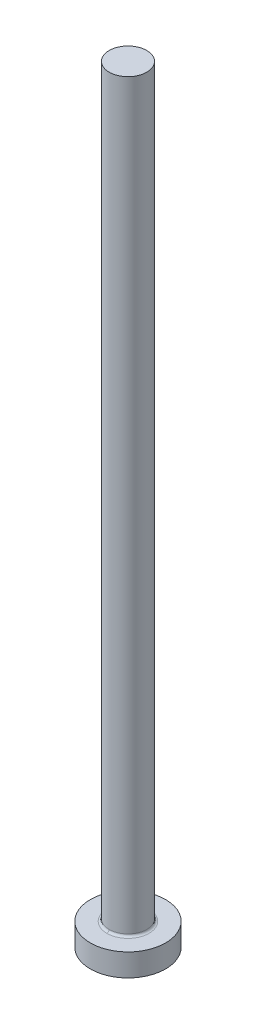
ISO-10303-21;
HEADER;
FILE_DESCRIPTION(('STEP AP214'),'2;1');
FILE_NAME('part.step','',(''),(''),'','','');
FILE_SCHEMA(('AUTOMOTIVE_DESIGN { 1 0 10303 214 1 1 1 1 }'));
ENDSEC;
DATA;
#1=APPLICATION_CONTEXT('core data for automotive mechanical design processes');
#2=APPLICATION_PROTOCOL_DEFINITION('international standard','automotive_design',2000,#1);
#3=PRODUCT_CONTEXT('',#1,'mechanical');
#4=PRODUCT('Part','Part','',(#3));
#5=PRODUCT_RELATED_PRODUCT_CATEGORY('part','',(#4));
#6=PRODUCT_DEFINITION_FORMATION('','',#4);
#7=PRODUCT_DEFINITION_CONTEXT('part definition',#1,'design');
#8=PRODUCT_DEFINITION('design','',#6,#7);
#9=PRODUCT_DEFINITION_SHAPE('','',#8);
#10=(LENGTH_UNIT() NAMED_UNIT(*) SI_UNIT(.MILLI.,.METRE.));
#11=(NAMED_UNIT(*) PLANE_ANGLE_UNIT() SI_UNIT($,.RADIAN.));
#12=(NAMED_UNIT(*) SI_UNIT($,.STERADIAN.) SOLID_ANGLE_UNIT());
#13=UNCERTAINTY_MEASURE_WITH_UNIT(LENGTH_MEASURE(1.E-05),#10,'distance_accuracy_value','');
#14=(GEOMETRIC_REPRESENTATION_CONTEXT(3) GLOBAL_UNCERTAINTY_ASSIGNED_CONTEXT((#13)) GLOBAL_UNIT_ASSIGNED_CONTEXT((#10,
#11,#12)) REPRESENTATION_CONTEXT('',''));
#15=CARTESIAN_POINT('',(0.,0.,0.));
#16=DIRECTION('',(0.,0.,1.));
#17=DIRECTION('',(1.,0.,0.));
#18=AXIS2_PLACEMENT_3D('',#15,#16,#17);
#19=CARTESIAN_POINT('',(31.993533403,-106.,50.58381783));
#20=DIRECTION('',(0.,-1.,0.));
#21=DIRECTION('',(0.,0.,1.));
#22=AXIS2_PLACEMENT_3D('',#19,#20,#21);
#23=PLANE('',#22);
#24=CARTESIAN_POINT('',(26.933533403,-106.,55.64381783));
#25=DIRECTION('',(0.,1.,0.));
#26=DIRECTION('',(-1.,0.,0.));
#27=AXIS2_PLACEMENT_3D('',#24,#25,#26);
#28=CIRCLE('',#27,5.);
#29=CARTESIAN_POINT('',(21.933533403,-106.,55.64381783));
#30=VERTEX_POINT('',#29);
#31=EDGE_CURVE('E29',#30,#30,#28,.F.);
#32=ORIENTED_EDGE('',*,*,#31,.T.);
#33=EDGE_LOOP('',(#32));
#34=FACE_BOUND('',#33,.T.);
#35=ADVANCED_FACE('F24',(#34),#23,.T.);
#36=CARTESIAN_POINT('',(26.933533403,-106.,55.64381783));
#37=DIRECTION('',(0.,1.,0.));
#38=DIRECTION('',(-1.,0.,0.));
#39=AXIS2_PLACEMENT_3D('',#36,#37,#38);
#40=CYLINDRICAL_SURFACE('',#39,5.);
#41=CARTESIAN_POINT('',(26.933533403,-103.,55.64381783));
#42=DIRECTION('',(0.,1.,0.));
#43=DIRECTION('',(-1.,0.,0.));
#44=AXIS2_PLACEMENT_3D('',#41,#42,#43);
#45=CIRCLE('',#44,5.);
#46=CARTESIAN_POINT('',(21.933533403,-103.,55.64381783));
#47=VERTEX_POINT('',#46);
#48=EDGE_CURVE('E66',#47,#47,#45,.T.);
#49=ORIENTED_EDGE('',*,*,#48,.F.);
#50=EDGE_LOOP('',(#49));
#51=FACE_BOUND('',#50,.T.);
#52=ORIENTED_EDGE('',*,*,#31,.F.);
#53=EDGE_LOOP('',(#52));
#54=FACE_BOUND('',#53,.T.);
#55=ADVANCED_FACE('F101',(#51,#54),#40,.T.);
#56=CARTESIAN_POINT('',(26.933533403,-102.99850125,52.813867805));
#57=CARTESIAN_POINT('',(21.273633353,-102.99850125,52.813867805));
#58=CARTESIAN_POINT('',(21.273633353,-102.99850125,58.473767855));
#59=CARTESIAN_POINT('',(26.933533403,-102.99850125,58.473767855));
#60=CARTESIAN_POINT('',(26.933533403,-103.018966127,53.017833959));
#61=CARTESIAN_POINT('',(21.681565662,-103.018966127,53.017833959));
#62=CARTESIAN_POINT('',(21.681565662,-103.018966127,58.2698017));
#63=CARTESIAN_POINT('',(26.933533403,-103.018966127,58.2698017));
#64=CARTESIAN_POINT('',(26.933533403,-102.87401613,53.162783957));
#65=CARTESIAN_POINT('',(21.971465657,-102.87401613,53.162783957));
#66=CARTESIAN_POINT('',(21.971465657,-102.87401613,58.124851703));
#67=CARTESIAN_POINT('',(26.933533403,-102.87401613,58.124851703));
#68=CARTESIAN_POINT('',(26.933533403,-102.670049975,53.142319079));
#69=CARTESIAN_POINT('',(21.930535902,-102.670049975,53.142319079));
#70=CARTESIAN_POINT('',(21.930535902,-102.670049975,58.14531658));
#71=CARTESIAN_POINT('',(26.933533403,-102.670049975,58.14531658));
#72=(BOUNDED_SURFACE() B_SPLINE_SURFACE(3,3,((#56,#57,#58,#59),(#60,#61,#62,#63),(#64,#65,#66,
#67),(#68,#69,#70,#71)),.UNSPECIFIED.,.F.,.F.,.F.) B_SPLINE_SURFACE_WITH_KNOTS((4,4),(4,4),(0.,
1.),(0.,1.),.UNSPECIFIED.) GEOMETRIC_REPRESENTATION_ITEM() RATIONAL_B_SPLINE_SURFACE(((1.,
0.333333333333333,0.333333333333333,1.),(0.75532087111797,0.25177362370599,0.25177362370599,
0.75532087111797),(0.75532087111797,0.25177362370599,0.25177362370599,0.75532087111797),(1.,
0.333333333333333,0.333333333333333,1.))) REPRESENTATION_ITEM('') SURFACE());
#73=CARTESIAN_POINT('',(26.933533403,-102.7,55.64381783));
#74=DIRECTION('',(0.,1.,0.));
#75=DIRECTION('',(0.,0.,-1.));
#76=AXIS2_PLACEMENT_3D('',#73,#74,#75);
#77=CIRCLE('',#76,2.5);
#78=CARTESIAN_POINT('',(26.9335334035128,-102.70000000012,58.1438178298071));
#79=VERTEX_POINT('',#78);
#80=CARTESIAN_POINT('',(26.9335334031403,-102.700000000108,53.1438178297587));
#81=VERTEX_POINT('',#80);
#82=EDGE_CURVE('E59',#79,#81,#77,.F.);
#83=CARTESIAN_POINT('',(26.933533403,-102.99850125,52.813867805));
#84=CARTESIAN_POINT('',(26.933533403,-103.018966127,53.017833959));
#85=CARTESIAN_POINT('',(26.933533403,-102.87401613,53.162783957));
#86=CARTESIAN_POINT('',(26.933533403,-102.670049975,53.142319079));
#87=(BOUNDED_CURVE() B_SPLINE_CURVE(3,(#83,#84,#85,#86),.UNSPECIFIED.,.F.,
.F.) B_SPLINE_CURVE_WITH_KNOTS((4,4),(0.,1.),
.UNSPECIFIED.) CURVE() GEOMETRIC_REPRESENTATION_ITEM() RATIONAL_B_SPLINE_CURVE((1.,
0.75532087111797,0.75532087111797,1.)) REPRESENTATION_ITEM(''));
#88=CARTESIAN_POINT('',(26.933533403,-103.000000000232,52.8438178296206));
#89=VERTEX_POINT('',#88);
#90=EDGE_CURVE('E53',#89,#81,#87,.T.);
#91=CARTESIAN_POINT('',(26.933533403,-103.000000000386,52.843817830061));
#92=CARTESIAN_POINT('',(21.3335334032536,-103.000000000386,52.8438178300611));
#93=CARTESIAN_POINT('',(21.3335334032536,-103.000000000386,58.4438178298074));
#94=CARTESIAN_POINT('',(26.933533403,-103.000000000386,58.4438178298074));
#95=(BOUNDED_CURVE() B_SPLINE_CURVE(3,(#91,#92,#93,#94),.UNSPECIFIED.,.F.,
.F.) B_SPLINE_CURVE_WITH_KNOTS((4,4),(0.,1.),
.UNSPECIFIED.) CURVE() GEOMETRIC_REPRESENTATION_ITEM() RATIONAL_B_SPLINE_CURVE((0.956578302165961,
0.31885943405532,0.31885943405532,0.956578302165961)) REPRESENTATION_ITEM(''));
#96=CARTESIAN_POINT('',(26.933533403,-103.000000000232,58.4438178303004));
#97=VERTEX_POINT('',#96);
#98=EDGE_CURVE('E56',#97,#89,#95,.F.);
#99=CARTESIAN_POINT('',(26.933533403,-102.99850125,58.473767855));
#100=CARTESIAN_POINT('',(26.933533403,-103.018966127,58.2698017));
#101=CARTESIAN_POINT('',(26.933533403,-102.87401613,58.124851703));
#102=CARTESIAN_POINT('',(26.933533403,-102.670049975,58.14531658));
#103=(BOUNDED_CURVE() B_SPLINE_CURVE(3,(#99,#100,#101,#102),.UNSPECIFIED.,.F.,
.F.) B_SPLINE_CURVE_WITH_KNOTS((4,4),(0.,1.),
.UNSPECIFIED.) CURVE() GEOMETRIC_REPRESENTATION_ITEM() RATIONAL_B_SPLINE_CURVE((1.,
0.75532087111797,0.75532087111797,1.)) REPRESENTATION_ITEM(''));
#104=EDGE_CURVE('E44',#79,#97,#103,.F.);
#105=ORIENTED_EDGE('',*,*,#82,.T.);
#106=ORIENTED_EDGE('',*,*,#90,.F.);
#107=ORIENTED_EDGE('',*,*,#98,.F.);
#108=ORIENTED_EDGE('',*,*,#104,.F.);
#109=EDGE_LOOP('',(#105,#106,#107,#108));
#110=FACE_BOUND('',#109,.T.);
#111=ADVANCED_FACE('F55',(#110),#72,.F.);
#112=CARTESIAN_POINT('',(24.403533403,-4.,53.11381783));
#113=DIRECTION('',(0.,1.,0.));
#114=DIRECTION('',(0.,0.,1.));
#115=AXIS2_PLACEMENT_3D('',#112,#113,#114);
#116=PLANE('',#115);
#117=CARTESIAN_POINT('',(26.9335334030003,-4.,55.64381783));
#118=DIRECTION('',(0.,1.,0.));
#119=DIRECTION('',(-1.,0.,0.));
#120=AXIS2_PLACEMENT_3D('',#117,#118,#119);
#121=CIRCLE('',#120,2.5);
#122=CARTESIAN_POINT('',(24.4335334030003,-4.,55.64381783));
#123=VERTEX_POINT('',#122);
#124=EDGE_CURVE('E65',#123,#123,#121,.T.);
#125=ORIENTED_EDGE('',*,*,#124,.T.);
#126=EDGE_LOOP('',(#125));
#127=FACE_BOUND('',#126,.T.);
#128=ADVANCED_FACE('F100',(#127),#116,.T.);
#129=CARTESIAN_POINT('',(31.993533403,-103.,60.70381783));
#130=DIRECTION('',(0.,1.,0.));
#131=DIRECTION('',(0.,0.,-1.));
#132=AXIS2_PLACEMENT_3D('',#129,#130,#131);
#133=PLANE('',#132);
#134=CARTESIAN_POINT('',(26.933533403,-103.000000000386,58.4438178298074));
#135=CARTESIAN_POINT('',(32.5335334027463,-103.000000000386,58.4438178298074));
#136=CARTESIAN_POINT('',(32.5335334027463,-103.000000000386,52.843817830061));
#137=CARTESIAN_POINT('',(26.933533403,-103.000000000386,52.843817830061));
#138=(BOUNDED_CURVE() B_SPLINE_CURVE(3,(#134,#135,#136,#137),.UNSPECIFIED.,.F.,
.F.) B_SPLINE_CURVE_WITH_KNOTS((4,4),(0.,1.),
.UNSPECIFIED.) CURVE() GEOMETRIC_REPRESENTATION_ITEM() RATIONAL_B_SPLINE_CURVE((0.956578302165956,
0.318859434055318,0.318859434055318,0.956578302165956)) REPRESENTATION_ITEM(''));
#139=EDGE_CURVE('E35',#89,#97,#138,.F.);
#140=ORIENTED_EDGE('',*,*,#139,.T.);
#141=ORIENTED_EDGE('',*,*,#98,.T.);
#142=EDGE_LOOP('',(#140,#141));
#143=FACE_BOUND('',#142,.T.);
#144=ORIENTED_EDGE('',*,*,#48,.T.);
#145=EDGE_LOOP('',(#144));
#146=FACE_BOUND('',#145,.T.);
#147=ADVANCED_FACE('F26',(#143,#146),#133,.T.);
#148=CARTESIAN_POINT('',(26.933533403,-102.7,55.64381783));
#149=DIRECTION('',(0.,1.,0.));
#150=DIRECTION('',(-1.,0.,0.));
#151=AXIS2_PLACEMENT_3D('',#148,#149,#150);
#152=CYLINDRICAL_SURFACE('',#151,2.5);
#153=CARTESIAN_POINT('',(26.933533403,-102.700000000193,55.6438178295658));
#154=DIRECTION('',(0.,1.,0.));
#155=DIRECTION('',(-1.,0.,0.));
#156=AXIS2_PLACEMENT_3D('',#153,#154,#155);
#157=CIRCLE('',#156,2.50000000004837);
#158=EDGE_CURVE('E13',#79,#81,#157,.T.);
#159=ORIENTED_EDGE('',*,*,#158,.T.);
#160=ORIENTED_EDGE('',*,*,#82,.F.);
#161=EDGE_LOOP('',(#159,#160));
#162=FACE_BOUND('',#161,.T.);
#163=ORIENTED_EDGE('',*,*,#124,.F.);
#164=EDGE_LOOP('',(#163));
#165=FACE_BOUND('',#164,.T.);
#166=ADVANCED_FACE('F86',(#162,#165),#152,.T.);
#167=CARTESIAN_POINT('',(26.933533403,-102.99850125,58.473767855));
#168=CARTESIAN_POINT('',(32.593433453,-102.99850125,58.473767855));
#169=CARTESIAN_POINT('',(32.593433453,-102.99850125,52.813867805));
#170=CARTESIAN_POINT('',(26.933533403,-102.99850125,52.813867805));
#171=CARTESIAN_POINT('',(26.933533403,-103.018966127,58.2698017));
#172=CARTESIAN_POINT('',(32.185501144,-103.018966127,58.2698017));
#173=CARTESIAN_POINT('',(32.185501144,-103.018966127,53.017833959));
#174=CARTESIAN_POINT('',(26.933533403,-103.018966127,53.017833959));
#175=CARTESIAN_POINT('',(26.933533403,-102.87401613,58.124851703));
#176=CARTESIAN_POINT('',(31.895601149,-102.87401613,58.124851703));
#177=CARTESIAN_POINT('',(31.895601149,-102.87401613,53.162783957));
#178=CARTESIAN_POINT('',(26.933533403,-102.87401613,53.162783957));
#179=CARTESIAN_POINT('',(26.933533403,-102.670049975,58.14531658));
#180=CARTESIAN_POINT('',(31.936530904,-102.670049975,58.14531658));
#181=CARTESIAN_POINT('',(31.936530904,-102.670049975,53.142319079));
#182=CARTESIAN_POINT('',(26.933533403,-102.670049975,53.142319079));
#183=(BOUNDED_SURFACE() B_SPLINE_SURFACE(3,3,((#167,#168,#169,#170),(#171,#172,#173,#174),(#175,
#176,#177,#178),(#179,#180,#181,#182)),.UNSPECIFIED.,.F.,.F.,
.F.) B_SPLINE_SURFACE_WITH_KNOTS((4,4),(4,4),(0.,1.),(0.,1.),
.UNSPECIFIED.) GEOMETRIC_REPRESENTATION_ITEM() RATIONAL_B_SPLINE_SURFACE(((1.,0.333333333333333,
0.333333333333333,1.),(0.75532087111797,0.25177362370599,0.25177362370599,0.75532087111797),
(0.75532087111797,0.25177362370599,0.25177362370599,0.75532087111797),(1.,0.333333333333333,
0.333333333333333,1.))) REPRESENTATION_ITEM('') SURFACE());
#184=ORIENTED_EDGE('',*,*,#104,.T.);
#185=ORIENTED_EDGE('',*,*,#139,.F.);
#186=ORIENTED_EDGE('',*,*,#90,.T.);
#187=ORIENTED_EDGE('',*,*,#158,.F.);
#188=EDGE_LOOP('',(#184,#185,#186,#187));
#189=FACE_BOUND('',#188,.T.);
#190=ADVANCED_FACE('F70',(#189),#183,.F.);
#191=CLOSED_SHELL('',(#35,#55,#111,#128,#147,#166,#190));
#192=MANIFOLD_SOLID_BREP('B1',#191);
#193=ADVANCED_BREP_SHAPE_REPRESENTATION('',(#18,#192),#14);
#194=SHAPE_DEFINITION_REPRESENTATION(#9,#193);
ENDSEC;
END-ISO-10303-21;
